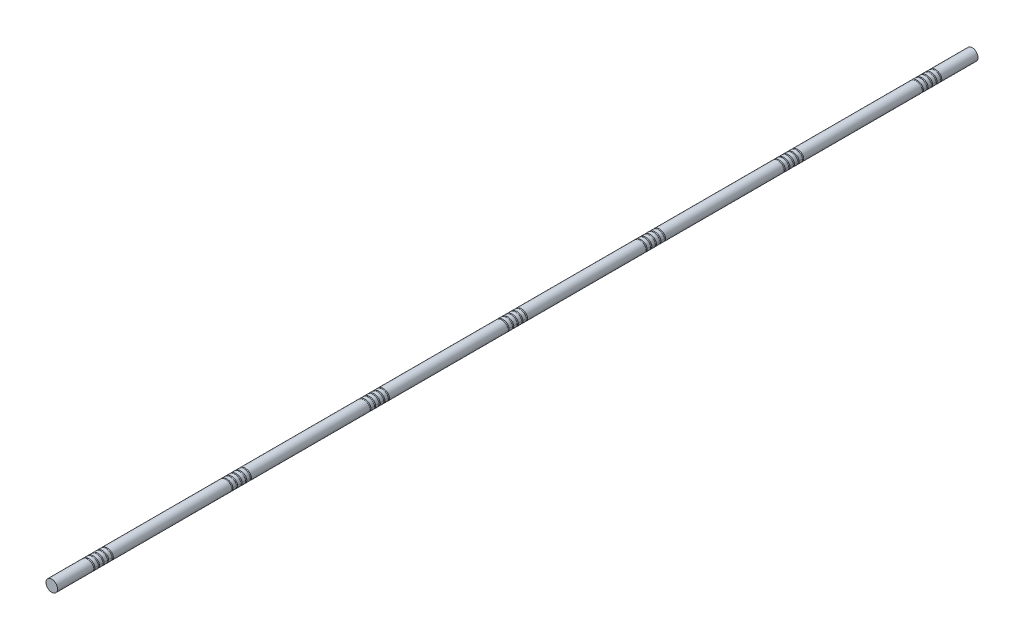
from build123d import *

# Parameters (mm, degrees)
SKETCH1_R              = 25
BOSS_EXTRUDE1_DEPTH    = 4000
CUT_SWEEP1_PITCH       = 20
CUT_SWEEP1_HEIGHT      = 100
CUT_SWEEP1_RADIUS      = 27.116666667
CUT_SWEEP1_START_ANGLE = -180
SKETCH3_R              = 3.175
LPATTERN1_COUNT        = 7
LPATTERN1_PITCH        = 600


with BuildPart() as part:
    # Sketch1 → Boss-Extrude1 (new body)
    with BuildSketch(Plane.XY):
        Circle(SKETCH1_R)
    extrude(amount=BOSS_EXTRUDE1_DEPTH)

    # Cut-Sweep1: sweep along a helix
    with BuildLine() as cut_sweep1_path:
        add(Helix(CUT_SWEEP1_PITCH, CUT_SWEEP1_HEIGHT, CUT_SWEEP1_RADIUS, center=(0, 0, 150), direction=(0, 0, 1), mode=Mode.PRIVATE).rotate(Axis((0, 0, 150), (0, 0, 1)), CUT_SWEEP1_START_ANGLE))
    # Sketch3 → Cut-Sweep1 (sweep, cut)
    with BuildSketch(Plane(origin=(0, 0, 0), x_dir=(1, 0, 0), z_dir=(0, 1, 0))):
        with Locations((-27.116666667, -150)):
            Circle(SKETCH3_R)
    cut_sweep1 = sweep(path=cut_sweep1_path.line, is_frenet=True, mode=Mode.SUBTRACT)

    # LPattern1: Cut-Sweep1 ×7
    with Locations(*[(0, 0, i * LPATTERN1_PITCH) for i in range(1, LPATTERN1_COUNT)]):
        add(cut_sweep1, mode=Mode.SUBTRACT)


solid = part.part
